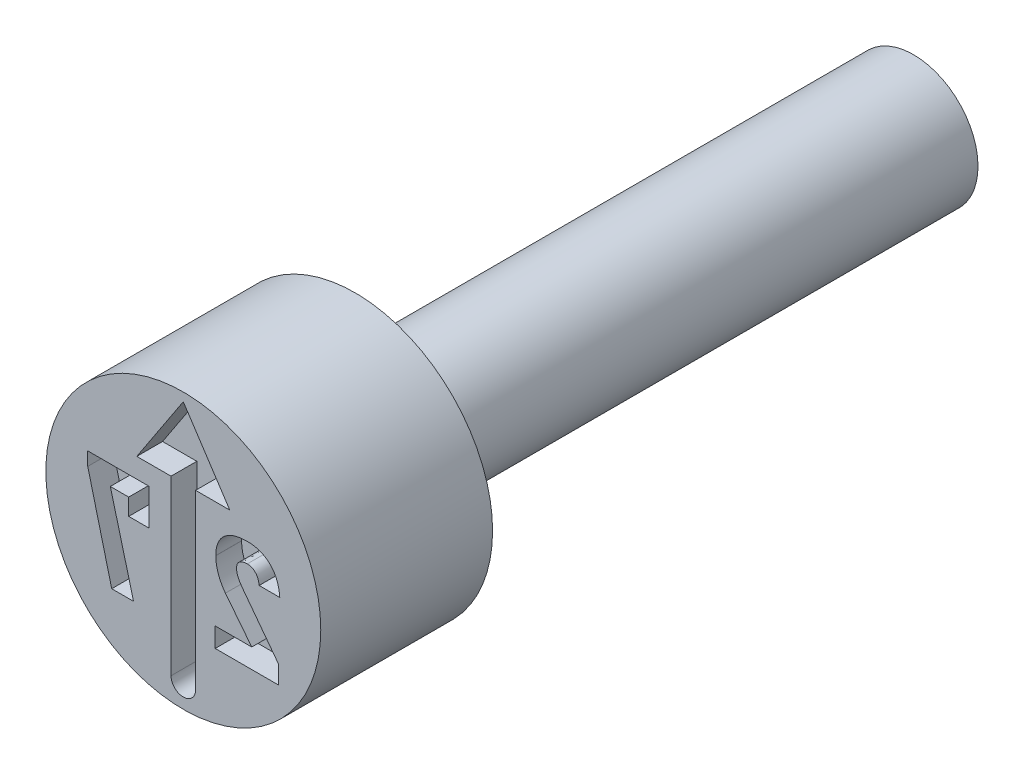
from build123d import *

# Parameters (mm, degrees)
CUT_EXTRUDE4_DEPTH = 0.6
CUT_EXTRUDE5_DEPTH = 0.6


with BuildPart() as part:
    # Sketch2 → Revolve1 (revolve)
    with BuildSketch(Plane(origin=(0, 0, 0), x_dir=(0, 0, -1), z_dir=(1, 0, 0)), mode=Mode.PRIVATE) as revolve1_sk:
        Polygon((0, 3.2), (0, 0), (17, 0), (17, 1.5), (4, 1.5), (4, 3.2), align=None)
    revolve(revolve1_sk.sketch.rotate(Axis((0, 0, -0.403888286), (0, 0, -1)), 90), axis=Axis((0, 0, -0.403888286), (0, 0, -1)))

    # Sketch3 → Cut-Extrude4 (cut)
    with BuildSketch(Plane.XY):
        with BuildLine():
            Line((0.285709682, 1.359527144), (0.285709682, -2.664242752))
            ThreePointArc((0.285709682, -2.664242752), (0, -2.949952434), (-0.285709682, -2.664242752))
            Line((-0.285709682, -2.664242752), (-0.285709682, 1.359527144))
            Line((-0.285709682, 1.359527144), (-1.082876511, 1.359527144))
            Line((-1.082876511, 1.359527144), (0, 3.00317302))
            Line((0, 3.00317302), (1.082876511, 1.359527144))
            Line((1.082876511, 1.359527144), (0.285709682, 1.359527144))
        make_face()
    extrude(amount=-CUT_EXTRUDE4_DEPTH, mode=Mode.SUBTRACT)

    # Sketch4 → Cut-Extrude5 (cut)
    with BuildSketch(Plane.XY):
        with BuildLine():
            Line((2.214833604, -1.6), (2.214833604, -1.174878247))
            Line((2.214833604, -1.174878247), (1.360531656, -0.043080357))
            add(Edge.make_bspline(
                [(1.360531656, -0.043080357), (1.342638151, -0.017867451), (1.3077732, 0.031259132), (1.276217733, 0.098724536), (1.256559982, 0.151618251), (1.247191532, 0.189976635), (1.240508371, 0.226574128), (1.239685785, 0.25062166), (1.239285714, 0.26231737)],
                knots=[0, 0, 0, 0, 1.664252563, 3.24274559, 3.998498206, 4.704056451, 5.369707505, 6, 6, 6, 6], degree=3))
            Line((1.239285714, 0.26231737), (1.239285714, 0.265868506))
            add(Edge.make_bspline(
                [(1.239285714, 0.265868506), (1.239978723, 0.281853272), (1.241306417, 0.312477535), (1.253815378, 0.355627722), (1.274316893, 0.393204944), (1.303680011, 0.424243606), (1.340234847, 0.448793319), (1.383973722, 0.466094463), (1.434324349, 0.476015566), (1.470063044, 0.4772645), (1.48887987, 0.477922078)],
                knots=[0, 0, 0, 0, 1.029992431, 1.973301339, 2.872554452, 3.768620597, 4.704316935, 5.693697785, 6.785705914, 8, 8, 8, 8], degree=3))
            add(Edge.make_bspline(
                [(1.48887987, 0.477922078), (1.507258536, 0.477204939), (1.542968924, 0.475811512), (1.593523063, 0.460368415), (1.639077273, 0.436144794), (1.678348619, 0.401580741), (1.710868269, 0.358184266), (1.737261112, 0.307081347), (1.755186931, 0.247349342), (1.761527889, 0.204591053), (1.764853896, 0.182163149)],
                knots=[0, 0, 0, 0, 0.980828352, 1.905783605, 2.800718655, 3.724477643, 4.680224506, 5.688112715, 6.78735127, 8, 8, 8, 8], degree=3))
            Line((1.764853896, 0.182163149), (1.764853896, 0.180641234))
            Line((1.764853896, 0.180641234), (2.245779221, 0.180641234))
            Line((2.245779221, 0.180641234), (2.245779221, 0.182163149))
            add(Edge.make_bspline(
                [(2.245779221, 0.182163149), (2.243406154, 0.211141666), (2.238773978, 0.267707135), (2.223587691, 0.34953167), (2.203960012, 0.426604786), (2.17899096, 0.498911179), (2.146905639, 0.565613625), (2.110856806, 0.628106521), (2.067499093, 0.684456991), (2.020038, 0.736550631), (1.967174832, 0.782433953), (1.910808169, 0.822909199), (1.850085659, 0.856591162), (1.78593045, 0.884532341), (1.717631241, 0.905738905), (1.646080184, 0.921624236), (1.570456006, 0.930785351), (1.518835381, 0.931898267), (1.492431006, 0.932467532)],
                knots=[0, 0, 0, 0, 1.173229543, 2.290119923, 3.354877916, 4.382703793, 5.372196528, 6.339367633, 7.289741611, 8.236749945, 9.180232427, 10.11040526, 11.033485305, 11.978374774, 12.930610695, 13.916256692, 14.93414813, 16, 16, 16, 16], degree=3))
            add(Edge.make_bspline(
                [(1.492431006, 0.932467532), (1.463998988, 0.932063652), (1.408702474, 0.931278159), (1.328200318, 0.922799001), (1.252456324, 0.910001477), (1.181592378, 0.891279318), (1.115892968, 0.866857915), (1.055161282, 0.837411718), (0.999270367, 0.802689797), (0.948648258, 0.762617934), (0.903100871, 0.71792416), (0.863896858, 0.668154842), (0.829959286, 0.614316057), (0.803430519, 0.555363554), (0.781589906, 0.492683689), (0.767448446, 0.425152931), (0.757918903, 0.353566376), (0.756868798, 0.304287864), (0.756331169, 0.279058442)],
                knots=[0, 0, 0, 0, 1.219700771, 2.37215663, 3.469774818, 4.513610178, 5.512457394, 6.473141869, 7.405450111, 8.330272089, 9.238546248, 10.1372905, 11.043445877, 11.962355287, 12.905558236, 13.886315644, 14.917844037, 16, 16, 16, 16], degree=3))
            Line((0.756331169, 0.279058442), (0.756331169, 0.277029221))
            add(Edge.make_bspline(
                [(0.756331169, 0.277029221), (0.756977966, 0.248583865), (0.758272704, 0.191642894), (0.769959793, 0.106422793), (0.788793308, 0.021637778), (0.814658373, -0.062302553), (0.846789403, -0.143944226), (0.885352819, -0.222169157), (0.928876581, -0.297011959), (0.963365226, -0.343204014), (0.980560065, -0.366233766)],
                knots=[0, 0, 0, 0, 0.984368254, 1.970475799, 2.971844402, 3.988480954, 5.008197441, 6.005725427, 7.005724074, 8, 8, 8, 8], degree=3))
            Line((0.980560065, -0.366233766), (1.59338474, -1.145454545))
            Line((1.59338474, -1.145454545), (0.742633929, -1.145454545))
            Line((0.742633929, -1.145454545), (0.742633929, -1.6))
            Line((0.742633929, -1.6), (2.214833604, -1.6))
        make_face()
        Polygon((-2.224431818, 0.9), (-2.224431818, 0.58648539), (-1.666396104, -1.6), (-1.158076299, -1.6), (-1.698863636, 0.445454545), (-1.271205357, 0.445454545), (-1.271205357, 0.055844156), (-0.801948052, 0.055844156), (-0.801948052, 0.9), align=None)
    extrude(amount=-CUT_EXTRUDE5_DEPTH, mode=Mode.SUBTRACT)


solid = part.part
